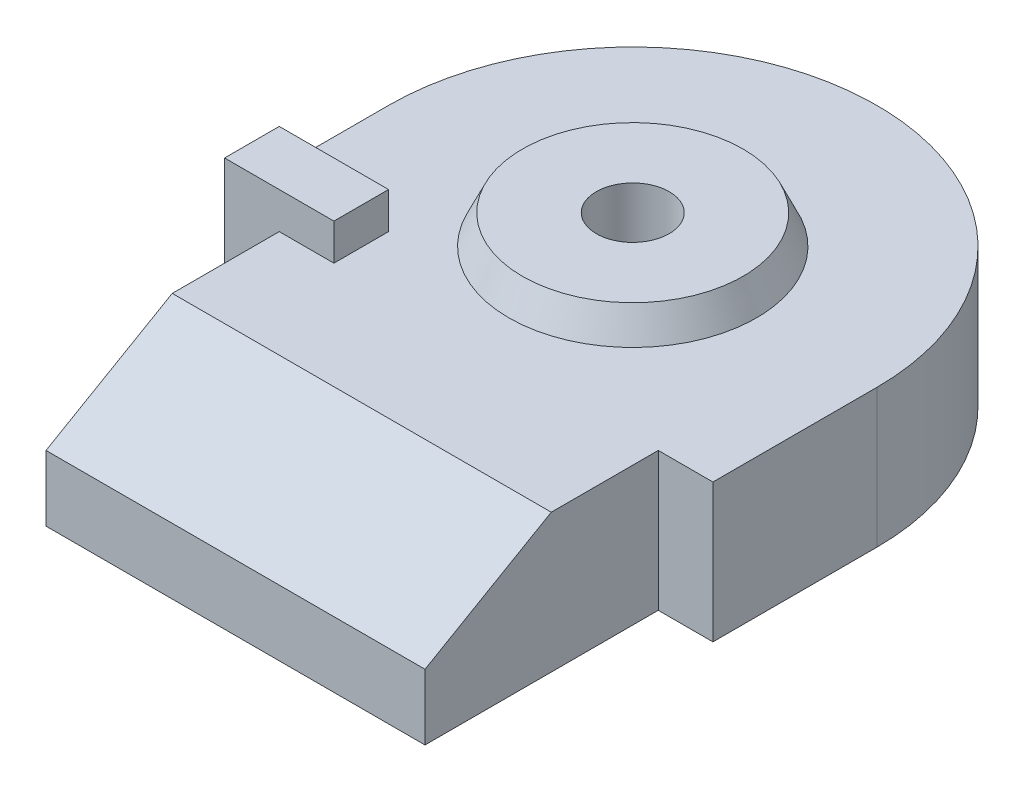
ISO-10303-21;
HEADER;
FILE_DESCRIPTION(('STEP AP214'),'2;1');
FILE_NAME('part.step','',(''),(''),'','','');
FILE_SCHEMA(('AUTOMOTIVE_DESIGN { 1 0 10303 214 1 1 1 1 }'));
ENDSEC;
DATA;
#1=APPLICATION_CONTEXT('core data for automotive mechanical design processes');
#2=APPLICATION_PROTOCOL_DEFINITION('international standard','automotive_design',2000,#1);
#3=PRODUCT_CONTEXT('',#1,'mechanical');
#4=PRODUCT('Part','Part','',(#3));
#5=PRODUCT_RELATED_PRODUCT_CATEGORY('part','',(#4));
#6=PRODUCT_DEFINITION_FORMATION('','',#4);
#7=PRODUCT_DEFINITION_CONTEXT('part definition',#1,'design');
#8=PRODUCT_DEFINITION('design','',#6,#7);
#9=PRODUCT_DEFINITION_SHAPE('','',#8);
#10=(LENGTH_UNIT() NAMED_UNIT(*) SI_UNIT(.MILLI.,.METRE.));
#11=(NAMED_UNIT(*) PLANE_ANGLE_UNIT() SI_UNIT($,.RADIAN.));
#12=(NAMED_UNIT(*) SI_UNIT($,.STERADIAN.) SOLID_ANGLE_UNIT());
#13=UNCERTAINTY_MEASURE_WITH_UNIT(LENGTH_MEASURE(1.E-05),#10,'distance_accuracy_value','');
#14=(GEOMETRIC_REPRESENTATION_CONTEXT(3) GLOBAL_UNCERTAINTY_ASSIGNED_CONTEXT((#13)) GLOBAL_UNIT_ASSIGNED_CONTEXT((#10,
#11,#12)) REPRESENTATION_CONTEXT('',''));
#15=CARTESIAN_POINT('',(0.,0.,0.));
#16=DIRECTION('',(0.,0.,1.));
#17=DIRECTION('',(1.,0.,0.));
#18=AXIS2_PLACEMENT_3D('',#15,#16,#17);
#19=CARTESIAN_POINT('',(0.,190.,0.));
#20=DIRECTION('',(0.,1.,0.));
#21=DIRECTION('',(0.,0.,1.));
#22=AXIS2_PLACEMENT_3D('',#19,#20,#21);
#23=PLANE('',#22);
#24=CARTESIAN_POINT('',(0.,190.,0.));
#25=DIRECTION('',(0.,1.,0.));
#26=DIRECTION('',(0.,0.,1.));
#27=AXIS2_PLACEMENT_3D('',#24,#25,#26);
#28=CIRCLE('',#27,170.);
#29=CARTESIAN_POINT('',(0.,190.,170.));
#30=VERTEX_POINT('',#29);
#31=EDGE_CURVE('E11',#30,#30,#28,.T.);
#32=ORIENTED_EDGE('',*,*,#31,.F.);
#33=EDGE_LOOP('',(#32));
#34=FACE_BOUND('',#33,.T.);
#35=DIRECTION('',(0.,0.,1.));
#36=VECTOR('',#35,1.);
#37=CARTESIAN_POINT('',(-260.,190.,225.));
#38=LINE('',#37,#36);
#39=CARTESIAN_POINT('',(-260.,190.,225.));
#40=VERTEX_POINT('',#39);
#41=CARTESIAN_POINT('',(-260.,190.,371.794919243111));
#42=VERTEX_POINT('',#41);
#43=EDGE_CURVE('E131',#40,#42,#38,.T.);
#44=ORIENTED_EDGE('',*,*,#43,.T.);
#45=DIRECTION('',(-1.,0.,0.));
#46=VECTOR('',#45,1.);
#47=CARTESIAN_POINT('',(1645.96073401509,190.,371.794919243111));
#48=LINE('',#47,#46);
#49=CARTESIAN_POINT('',(260.,190.,371.794919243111));
#50=VERTEX_POINT('',#49);
#51=EDGE_CURVE('E46',#50,#42,#48,.T.);
#52=ORIENTED_EDGE('',*,*,#51,.F.);
#53=DIRECTION('',(0.,0.,-1.));
#54=VECTOR('',#53,1.);
#55=CARTESIAN_POINT('',(260.,190.,225.));
#56=LINE('',#55,#54);
#57=CARTESIAN_POINT('',(260.,190.,225.));
#58=VERTEX_POINT('',#57);
#59=EDGE_CURVE('E136',#50,#58,#56,.T.);
#60=ORIENTED_EDGE('',*,*,#59,.T.);
#61=DIRECTION('',(1.,0.,0.));
#62=VECTOR('',#61,1.);
#63=CARTESIAN_POINT('',(335.,190.,225.));
#64=LINE('',#63,#62);
#65=CARTESIAN_POINT('',(335.,190.,225.));
#66=VERTEX_POINT('',#65);
#67=EDGE_CURVE('E172',#58,#66,#64,.T.);
#68=ORIENTED_EDGE('',*,*,#67,.T.);
#69=DIRECTION('',(0.,0.,-1.));
#70=VECTOR('',#69,1.);
#71=CARTESIAN_POINT('',(335.,190.,0.));
#72=LINE('',#71,#70);
#73=CARTESIAN_POINT('',(335.,190.,0.));
#74=VERTEX_POINT('',#73);
#75=EDGE_CURVE('E174',#66,#74,#72,.T.);
#76=ORIENTED_EDGE('',*,*,#75,.T.);
#77=CARTESIAN_POINT('',(0.,190.,0.));
#78=DIRECTION('',(0.,1.,0.));
#79=DIRECTION('',(0.,0.,1.));
#80=AXIS2_PLACEMENT_3D('',#77,#78,#79);
#81=CIRCLE('',#80,335.);
#82=CARTESIAN_POINT('',(-335.,190.,0.));
#83=VERTEX_POINT('',#82);
#84=EDGE_CURVE('E176',#74,#83,#81,.T.);
#85=ORIENTED_EDGE('',*,*,#84,.T.);
#86=DIRECTION('',(0.,0.,1.));
#87=VECTOR('',#86,1.);
#88=CARTESIAN_POINT('',(-335.,190.,0.));
#89=LINE('',#88,#87);
#90=CARTESIAN_POINT('',(-335.,190.,150.));
#91=VERTEX_POINT('',#90);
#92=EDGE_CURVE('E178',#83,#91,#89,.T.);
#93=ORIENTED_EDGE('',*,*,#92,.T.);
#94=DIRECTION('',(-1.,0.,0.));
#95=VECTOR('',#94,1.);
#96=CARTESIAN_POINT('',(-335.,190.,150.));
#97=LINE('',#96,#95);
#98=CARTESIAN_POINT('',(-185.,190.,150.));
#99=VERTEX_POINT('',#98);
#100=EDGE_CURVE('E153',#99,#91,#97,.T.);
#101=ORIENTED_EDGE('',*,*,#100,.F.);
#102=DIRECTION('',(0.,0.,-1.));
#103=VECTOR('',#102,1.);
#104=CARTESIAN_POINT('',(-185.,190.,225.));
#105=LINE('',#104,#103);
#106=CARTESIAN_POINT('',(-185.,190.,225.));
#107=VERTEX_POINT('',#106);
#108=EDGE_CURVE('E158',#107,#99,#105,.T.);
#109=ORIENTED_EDGE('',*,*,#108,.F.);
#110=DIRECTION('',(1.,0.,0.));
#111=VECTOR('',#110,1.);
#112=CARTESIAN_POINT('',(-335.,190.,225.));
#113=LINE('',#112,#111);
#114=EDGE_CURVE('E141',#40,#107,#113,.T.);
#115=ORIENTED_EDGE('',*,*,#114,.F.);
#116=EDGE_LOOP('',(#44,#52,#60,#68,#76,#85,#93,#101,#109,#115));
#117=FACE_BOUND('',#116,.T.);
#118=ADVANCED_FACE('F31',(#34,#117),#23,.T.);
#119=CARTESIAN_POINT('',(260.,190.,225.));
#120=DIRECTION('',(-1.,0.,0.));
#121=DIRECTION('',(0.,0.,1.));
#122=AXIS2_PLACEMENT_3D('',#119,#120,#121);
#123=PLANE('',#122);
#124=DIRECTION('',(0.,0.499999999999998,-0.86602540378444));
#125=VECTOR('',#124,1.);
#126=CARTESIAN_POINT('',(260.,253.56406460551,261.698729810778));
#127=LINE('',#126,#125);
#128=CARTESIAN_POINT('',(260.,90.,545.));
#129=VERTEX_POINT('',#128);
#130=EDGE_CURVE('E134',#129,#50,#127,.T.);
#131=ORIENTED_EDGE('',*,*,#130,.F.);
#132=DIRECTION('',(0.,-1.,0.));
#133=VECTOR('',#132,1.);
#134=CARTESIAN_POINT('',(260.,190.,545.));
#135=LINE('',#134,#133);
#136=CARTESIAN_POINT('',(260.,0.,545.));
#137=VERTEX_POINT('',#136);
#138=EDGE_CURVE('E121',#129,#137,#135,.T.);
#139=ORIENTED_EDGE('',*,*,#138,.T.);
#140=DIRECTION('',(0.,0.,-1.));
#141=VECTOR('',#140,1.);
#142=CARTESIAN_POINT('',(260.,0.,225.));
#143=LINE('',#142,#141);
#144=CARTESIAN_POINT('',(260.,0.,225.));
#145=VERTEX_POINT('',#144);
#146=EDGE_CURVE('E170',#137,#145,#143,.T.);
#147=ORIENTED_EDGE('',*,*,#146,.T.);
#148=DIRECTION('',(0.,-1.,0.));
#149=VECTOR('',#148,1.);
#150=CARTESIAN_POINT('',(260.,190.,225.));
#151=LINE('',#150,#149);
#152=EDGE_CURVE('E143',#58,#145,#151,.T.);
#153=ORIENTED_EDGE('',*,*,#152,.F.);
#154=ORIENTED_EDGE('',*,*,#59,.F.);
#155=EDGE_LOOP('',(#131,#139,#147,#153,#154));
#156=FACE_BOUND('',#155,.T.);
#157=ADVANCED_FACE('F33',(#156),#123,.F.);
#158=CARTESIAN_POINT('',(-260.,190.,225.));
#159=DIRECTION('',(1.,0.,0.));
#160=DIRECTION('',(0.,0.,-1.));
#161=AXIS2_PLACEMENT_3D('',#158,#159,#160);
#162=PLANE('',#161);
#163=DIRECTION('',(0.,-0.499999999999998,0.86602540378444));
#164=VECTOR('',#163,1.);
#165=CARTESIAN_POINT('',(-260.,253.56406460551,261.698729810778));
#166=LINE('',#165,#164);
#167=CARTESIAN_POINT('',(-260.,90.,545.));
#168=VERTEX_POINT('',#167);
#169=EDGE_CURVE('E54',#42,#168,#166,.T.);
#170=ORIENTED_EDGE('',*,*,#169,.F.);
#171=ORIENTED_EDGE('',*,*,#43,.F.);
#172=DIRECTION('',(0.,-1.,0.));
#173=VECTOR('',#172,1.);
#174=CARTESIAN_POINT('',(-260.,190.,225.));
#175=LINE('',#174,#173);
#176=CARTESIAN_POINT('',(-260.,0.,225.));
#177=VERTEX_POINT('',#176);
#178=EDGE_CURVE('E188',#40,#177,#175,.T.);
#179=ORIENTED_EDGE('',*,*,#178,.T.);
#180=DIRECTION('',(0.,0.,1.));
#181=VECTOR('',#180,1.);
#182=CARTESIAN_POINT('',(-260.,0.,225.));
#183=LINE('',#182,#181);
#184=CARTESIAN_POINT('',(-260.,0.,545.));
#185=VERTEX_POINT('',#184);
#186=EDGE_CURVE('E249',#177,#185,#183,.T.);
#187=ORIENTED_EDGE('',*,*,#186,.T.);
#188=DIRECTION('',(0.,-1.,0.));
#189=VECTOR('',#188,1.);
#190=CARTESIAN_POINT('',(-260.,190.,545.));
#191=LINE('',#190,#189);
#192=EDGE_CURVE('E130',#168,#185,#191,.T.);
#193=ORIENTED_EDGE('',*,*,#192,.F.);
#194=EDGE_LOOP('',(#170,#171,#179,#187,#193));
#195=FACE_BOUND('',#194,.T.);
#196=ADVANCED_FACE('F287',(#195),#162,.F.);
#197=CARTESIAN_POINT('',(-260.,190.,545.));
#198=DIRECTION('',(0.,0.,-1.));
#199=DIRECTION('',(-1.,0.,0.));
#200=AXIS2_PLACEMENT_3D('',#197,#198,#199);
#201=PLANE('',#200);
#202=DIRECTION('',(1.,0.,0.));
#203=VECTOR('',#202,1.);
#204=CARTESIAN_POINT('',(-260.,90.,545.));
#205=LINE('',#204,#203);
#206=EDGE_CURVE('E39',#168,#129,#205,.T.);
#207=ORIENTED_EDGE('',*,*,#206,.F.);
#208=ORIENTED_EDGE('',*,*,#192,.T.);
#209=DIRECTION('',(1.,0.,0.));
#210=VECTOR('',#209,1.);
#211=CARTESIAN_POINT('',(-260.,0.,545.));
#212=LINE('',#211,#210);
#213=EDGE_CURVE('E126',#185,#137,#212,.T.);
#214=ORIENTED_EDGE('',*,*,#213,.T.);
#215=ORIENTED_EDGE('',*,*,#138,.F.);
#216=EDGE_LOOP('',(#207,#208,#214,#215));
#217=FACE_BOUND('',#216,.T.);
#218=ADVANCED_FACE('F123',(#217),#201,.F.);
#219=CARTESIAN_POINT('',(0.,0.,0.));
#220=DIRECTION('',(0.,1.,0.));
#221=DIRECTION('',(0.,0.,1.));
#222=AXIS2_PLACEMENT_3D('',#219,#220,#221);
#223=PLANE('',#222);
#224=ORIENTED_EDGE('',*,*,#146,.F.);
#225=ORIENTED_EDGE('',*,*,#213,.F.);
#226=ORIENTED_EDGE('',*,*,#186,.F.);
#227=DIRECTION('',(1.,0.,0.));
#228=VECTOR('',#227,1.);
#229=CARTESIAN_POINT('',(-335.,0.,225.));
#230=LINE('',#229,#228);
#231=CARTESIAN_POINT('',(-335.,0.,225.));
#232=VERTEX_POINT('',#231);
#233=EDGE_CURVE('E247',#232,#177,#230,.T.);
#234=ORIENTED_EDGE('',*,*,#233,.F.);
#235=DIRECTION('',(0.,0.,1.));
#236=VECTOR('',#235,1.);
#237=CARTESIAN_POINT('',(-335.,0.,0.));
#238=LINE('',#237,#236);
#239=CARTESIAN_POINT('',(-335.,0.,0.));
#240=VERTEX_POINT('',#239);
#241=EDGE_CURVE('E225',#240,#232,#238,.T.);
#242=ORIENTED_EDGE('',*,*,#241,.F.);
#243=CARTESIAN_POINT('',(0.,0.,0.));
#244=DIRECTION('',(0.,1.,0.));
#245=DIRECTION('',(0.,0.,1.));
#246=AXIS2_PLACEMENT_3D('',#243,#244,#245);
#247=CIRCLE('',#246,335.);
#248=CARTESIAN_POINT('',(335.,0.,0.));
#249=VERTEX_POINT('',#248);
#250=EDGE_CURVE('E245',#249,#240,#247,.T.);
#251=ORIENTED_EDGE('',*,*,#250,.F.);
#252=DIRECTION('',(0.,0.,-1.));
#253=VECTOR('',#252,1.);
#254=CARTESIAN_POINT('',(335.,0.,0.));
#255=LINE('',#254,#253);
#256=CARTESIAN_POINT('',(335.,0.,225.));
#257=VERTEX_POINT('',#256);
#258=EDGE_CURVE('E251',#257,#249,#255,.T.);
#259=ORIENTED_EDGE('',*,*,#258,.F.);
#260=DIRECTION('',(1.,0.,0.));
#261=VECTOR('',#260,1.);
#262=CARTESIAN_POINT('',(335.,0.,225.));
#263=LINE('',#262,#261);
#264=EDGE_CURVE('E269',#145,#257,#263,.T.);
#265=ORIENTED_EDGE('',*,*,#264,.F.);
#266=EDGE_LOOP('',(#224,#225,#226,#234,#242,#251,#259,#265));
#267=FACE_BOUND('',#266,.T.);
#268=CARTESIAN_POINT('',(0.,0.,0.));
#269=DIRECTION('',(0.,1.,0.));
#270=DIRECTION('',(0.,0.,1.));
#271=AXIS2_PLACEMENT_3D('',#268,#269,#270);
#272=CIRCLE('',#271,50.);
#273=CARTESIAN_POINT('',(0.,0.,-50.));
#274=VERTEX_POINT('',#273);
#275=EDGE_CURVE('E138',#274,#274,#272,.T.);
#276=ORIENTED_EDGE('',*,*,#275,.T.);
#277=EDGE_LOOP('',(#276));
#278=FACE_BOUND('',#277,.T.);
#279=ADVANCED_FACE('F242',(#267,#278),#223,.F.);
#280=CARTESIAN_POINT('',(335.,190.,225.));
#281=DIRECTION('',(0.,0.,-1.));
#282=DIRECTION('',(-1.,0.,0.));
#283=AXIS2_PLACEMENT_3D('',#280,#281,#282);
#284=PLANE('',#283);
#285=ORIENTED_EDGE('',*,*,#264,.T.);
#286=DIRECTION('',(0.,-1.,0.));
#287=VECTOR('',#286,1.);
#288=CARTESIAN_POINT('',(335.,190.,225.));
#289=LINE('',#288,#287);
#290=EDGE_CURVE('E260',#66,#257,#289,.T.);
#291=ORIENTED_EDGE('',*,*,#290,.F.);
#292=ORIENTED_EDGE('',*,*,#67,.F.);
#293=ORIENTED_EDGE('',*,*,#152,.T.);
#294=EDGE_LOOP('',(#285,#291,#292,#293));
#295=FACE_BOUND('',#294,.T.);
#296=ADVANCED_FACE('F268',(#295),#284,.F.);
#297=CARTESIAN_POINT('',(335.,190.,0.));
#298=DIRECTION('',(-1.,0.,0.));
#299=DIRECTION('',(0.,0.,1.));
#300=AXIS2_PLACEMENT_3D('',#297,#298,#299);
#301=PLANE('',#300);
#302=ORIENTED_EDGE('',*,*,#258,.T.);
#303=DIRECTION('',(0.,-1.,0.));
#304=VECTOR('',#303,1.);
#305=CARTESIAN_POINT('',(335.,190.,0.));
#306=LINE('',#305,#304);
#307=EDGE_CURVE('E238',#74,#249,#306,.T.);
#308=ORIENTED_EDGE('',*,*,#307,.F.);
#309=ORIENTED_EDGE('',*,*,#75,.F.);
#310=ORIENTED_EDGE('',*,*,#290,.T.);
#311=EDGE_LOOP('',(#302,#308,#309,#310));
#312=FACE_BOUND('',#311,.T.);
#313=ADVANCED_FACE('F271',(#312),#301,.F.);
#314=CARTESIAN_POINT('',(0.,190.,0.));
#315=DIRECTION('',(0.,-1.,0.));
#316=DIRECTION('',(0.,0.,-1.));
#317=AXIS2_PLACEMENT_3D('',#314,#315,#316);
#318=CYLINDRICAL_SURFACE('',#317,335.);
#319=ORIENTED_EDGE('',*,*,#250,.T.);
#320=DIRECTION('',(0.,-1.,0.));
#321=VECTOR('',#320,1.);
#322=CARTESIAN_POINT('',(-335.,190.,0.));
#323=LINE('',#322,#321);
#324=EDGE_CURVE('E228',#83,#240,#323,.T.);
#325=ORIENTED_EDGE('',*,*,#324,.F.);
#326=ORIENTED_EDGE('',*,*,#84,.F.);
#327=ORIENTED_EDGE('',*,*,#307,.T.);
#328=EDGE_LOOP('',(#319,#325,#326,#327));
#329=FACE_BOUND('',#328,.T.);
#330=ADVANCED_FACE('F272',(#329),#318,.T.);
#331=CARTESIAN_POINT('',(-335.,190.,0.));
#332=DIRECTION('',(1.,0.,0.));
#333=DIRECTION('',(0.,0.,-1.));
#334=AXIS2_PLACEMENT_3D('',#331,#332,#333);
#335=PLANE('',#334);
#336=ORIENTED_EDGE('',*,*,#241,.T.);
#337=DIRECTION('',(0.,-1.,0.));
#338=VECTOR('',#337,1.);
#339=CARTESIAN_POINT('',(-335.,190.,225.));
#340=LINE('',#339,#338);
#341=CARTESIAN_POINT('',(-335.,240.,225.));
#342=VERTEX_POINT('',#341);
#343=EDGE_CURVE('E191',#342,#232,#340,.T.);
#344=ORIENTED_EDGE('',*,*,#343,.F.);
#345=DIRECTION('',(0.,0.,1.));
#346=VECTOR('',#345,1.);
#347=CARTESIAN_POINT('',(-335.,240.,225.));
#348=LINE('',#347,#346);
#349=CARTESIAN_POINT('',(-335.,240.,150.));
#350=VERTEX_POINT('',#349);
#351=EDGE_CURVE('E157',#350,#342,#348,.T.);
#352=ORIENTED_EDGE('',*,*,#351,.F.);
#353=DIRECTION('',(0.,-1.,0.));
#354=VECTOR('',#353,1.);
#355=CARTESIAN_POINT('',(-335.,240.,150.));
#356=LINE('',#355,#354);
#357=EDGE_CURVE('E148',#350,#91,#356,.T.);
#358=ORIENTED_EDGE('',*,*,#357,.T.);
#359=ORIENTED_EDGE('',*,*,#92,.F.);
#360=ORIENTED_EDGE('',*,*,#324,.T.);
#361=EDGE_LOOP('',(#336,#344,#352,#358,#359,#360));
#362=FACE_BOUND('',#361,.T.);
#363=ADVANCED_FACE('F220',(#362),#335,.F.);
#364=CARTESIAN_POINT('',(-335.,190.,225.));
#365=DIRECTION('',(0.,0.,-1.));
#366=DIRECTION('',(-1.,0.,0.));
#367=AXIS2_PLACEMENT_3D('',#364,#365,#366);
#368=PLANE('',#367);
#369=ORIENTED_EDGE('',*,*,#233,.T.);
#370=ORIENTED_EDGE('',*,*,#178,.F.);
#371=ORIENTED_EDGE('',*,*,#114,.T.);
#372=DIRECTION('',(0.,-1.,0.));
#373=VECTOR('',#372,1.);
#374=CARTESIAN_POINT('',(-185.,240.,225.));
#375=LINE('',#374,#373);
#376=CARTESIAN_POINT('',(-185.,240.,225.));
#377=VERTEX_POINT('',#376);
#378=EDGE_CURVE('E167',#377,#107,#375,.T.);
#379=ORIENTED_EDGE('',*,*,#378,.F.);
#380=DIRECTION('',(1.,0.,0.));
#381=VECTOR('',#380,1.);
#382=CARTESIAN_POINT('',(-335.,240.,225.));
#383=LINE('',#382,#381);
#384=EDGE_CURVE('E206',#342,#377,#383,.T.);
#385=ORIENTED_EDGE('',*,*,#384,.F.);
#386=ORIENTED_EDGE('',*,*,#343,.T.);
#387=EDGE_LOOP('',(#369,#370,#371,#379,#385,#386));
#388=FACE_BOUND('',#387,.T.);
#389=ADVANCED_FACE('F231',(#388),#368,.F.);
#390=CARTESIAN_POINT('',(-185.,240.,225.));
#391=DIRECTION('',(-1.,0.,0.));
#392=DIRECTION('',(0.,0.,1.));
#393=AXIS2_PLACEMENT_3D('',#390,#391,#392);
#394=PLANE('',#393);
#395=ORIENTED_EDGE('',*,*,#108,.T.);
#396=DIRECTION('',(0.,-1.,0.));
#397=VECTOR('',#396,1.);
#398=CARTESIAN_POINT('',(-185.,240.,150.));
#399=LINE('',#398,#397);
#400=CARTESIAN_POINT('',(-185.,240.,150.));
#401=VERTEX_POINT('',#400);
#402=EDGE_CURVE('E151',#401,#99,#399,.T.);
#403=ORIENTED_EDGE('',*,*,#402,.F.);
#404=DIRECTION('',(0.,0.,-1.));
#405=VECTOR('',#404,1.);
#406=CARTESIAN_POINT('',(-185.,240.,225.));
#407=LINE('',#406,#405);
#408=EDGE_CURVE('E208',#377,#401,#407,.T.);
#409=ORIENTED_EDGE('',*,*,#408,.F.);
#410=ORIENTED_EDGE('',*,*,#378,.T.);
#411=EDGE_LOOP('',(#395,#403,#409,#410));
#412=FACE_BOUND('',#411,.T.);
#413=ADVANCED_FACE('F234',(#412),#394,.F.);
#414=CARTESIAN_POINT('',(-335.,240.,150.));
#415=DIRECTION('',(0.,0.,1.));
#416=DIRECTION('',(1.,0.,0.));
#417=AXIS2_PLACEMENT_3D('',#414,#415,#416);
#418=PLANE('',#417);
#419=ORIENTED_EDGE('',*,*,#100,.T.);
#420=ORIENTED_EDGE('',*,*,#357,.F.);
#421=DIRECTION('',(-1.,0.,0.));
#422=VECTOR('',#421,1.);
#423=CARTESIAN_POINT('',(-335.,240.,150.));
#424=LINE('',#423,#422);
#425=EDGE_CURVE('E152',#401,#350,#424,.T.);
#426=ORIENTED_EDGE('',*,*,#425,.F.);
#427=ORIENTED_EDGE('',*,*,#402,.T.);
#428=EDGE_LOOP('',(#419,#420,#426,#427));
#429=FACE_BOUND('',#428,.T.);
#430=ADVANCED_FACE('F217',(#429),#418,.F.);
#431=CARTESIAN_POINT('',(-335.,240.,150.));
#432=DIRECTION('',(0.,-1.,0.));
#433=DIRECTION('',(0.,0.,-1.));
#434=AXIS2_PLACEMENT_3D('',#431,#432,#433);
#435=PLANE('',#434);
#436=ORIENTED_EDGE('',*,*,#351,.T.);
#437=ORIENTED_EDGE('',*,*,#384,.T.);
#438=ORIENTED_EDGE('',*,*,#408,.T.);
#439=ORIENTED_EDGE('',*,*,#425,.T.);
#440=EDGE_LOOP('',(#436,#437,#438,#439));
#441=FACE_BOUND('',#440,.T.);
#442=ADVANCED_FACE('F212',(#441),#435,.F.);
#443=CARTESIAN_POINT('',(0.,240.000025,0.));
#444=DIRECTION('',(0.,-1.,0.));
#445=DIRECTION('',(0.,0.,-1.));
#446=AXIS2_PLACEMENT_3D('',#443,#444,#445);
#447=CYLINDRICAL_SURFACE('',#446,50.);
#448=CARTESIAN_POINT('',(0.,230.,0.));
#449=DIRECTION('',(0.,-1.,0.));
#450=DIRECTION('',(0.,0.,-1.));
#451=AXIS2_PLACEMENT_3D('',#448,#449,#450);
#452=CIRCLE('',#451,50.);
#453=CARTESIAN_POINT('',(0.,230.,-50.));
#454=VERTEX_POINT('',#453);
#455=EDGE_CURVE('E194',#454,#454,#452,.T.);
#456=CARTESIAN_POINT('',(0.,0.,-50.));
#457=CARTESIAN_POINT('',(0.,2.39583333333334,-50.));
#458=CARTESIAN_POINT('',(0.,4.79166666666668,-50.));
#459=CARTESIAN_POINT('',(0.,9.58333333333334,-50.));
#460=CARTESIAN_POINT('',(0.,11.9791666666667,-50.));
#461=CARTESIAN_POINT('',(0.,16.7708333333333,-50.));
#462=CARTESIAN_POINT('',(0.,19.1666666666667,-50.));
#463=CARTESIAN_POINT('',(0.,23.9583333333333,-50.));
#464=CARTESIAN_POINT('',(0.,26.3541666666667,-50.));
#465=CARTESIAN_POINT('',(0.,31.1458333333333,-50.));
#466=CARTESIAN_POINT('',(0.,33.5416666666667,-50.));
#467=CARTESIAN_POINT('',(0.,38.3333333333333,-50.));
#468=CARTESIAN_POINT('',(0.,40.7291666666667,-50.));
#469=CARTESIAN_POINT('',(0.,45.5208333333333,-50.));
#470=CARTESIAN_POINT('',(0.,47.9166666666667,-50.));
#471=CARTESIAN_POINT('',(0.,52.7083333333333,-50.));
#472=CARTESIAN_POINT('',(0.,55.1041666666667,-50.));
#473=CARTESIAN_POINT('',(0.,59.8958333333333,-50.));
#474=CARTESIAN_POINT('',(0.,62.2916666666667,-50.));
#475=CARTESIAN_POINT('',(0.,67.0833333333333,-50.));
#476=CARTESIAN_POINT('',(0.,69.4791666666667,-50.));
#477=CARTESIAN_POINT('',(0.,74.2708333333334,-50.));
#478=CARTESIAN_POINT('',(0.,76.6666666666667,-50.));
#479=CARTESIAN_POINT('',(0.,81.4583333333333,-50.));
#480=CARTESIAN_POINT('',(0.,83.8541666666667,-50.));
#481=CARTESIAN_POINT('',(0.,88.6458333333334,-50.));
#482=CARTESIAN_POINT('',(0.,91.0416666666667,-50.));
#483=CARTESIAN_POINT('',(0.,95.8333333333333,-50.));
#484=CARTESIAN_POINT('',(0.,98.2291666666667,-50.));
#485=CARTESIAN_POINT('',(0.,103.020833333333,-50.));
#486=CARTESIAN_POINT('',(0.,105.416666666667,-50.));
#487=CARTESIAN_POINT('',(0.,110.208333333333,-50.));
#488=CARTESIAN_POINT('',(0.,112.604166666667,-50.));
#489=CARTESIAN_POINT('',(0.,117.395833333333,-50.));
#490=CARTESIAN_POINT('',(0.,119.791666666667,-50.));
#491=CARTESIAN_POINT('',(0.,124.583333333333,-50.));
#492=CARTESIAN_POINT('',(0.,126.979166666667,-50.));
#493=CARTESIAN_POINT('',(0.,131.770833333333,-50.));
#494=CARTESIAN_POINT('',(0.,134.166666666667,-50.));
#495=CARTESIAN_POINT('',(0.,138.958333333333,-50.));
#496=CARTESIAN_POINT('',(0.,141.354166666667,-50.));
#497=CARTESIAN_POINT('',(0.,146.145833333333,-50.));
#498=CARTESIAN_POINT('',(0.,148.541666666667,-50.));
#499=CARTESIAN_POINT('',(0.,153.333333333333,-50.));
#500=CARTESIAN_POINT('',(0.,155.729166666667,-50.));
#501=CARTESIAN_POINT('',(0.,160.520833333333,-50.));
#502=CARTESIAN_POINT('',(0.,162.916666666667,-50.));
#503=CARTESIAN_POINT('',(0.,167.708333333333,-50.));
#504=CARTESIAN_POINT('',(0.,170.104166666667,-50.));
#505=CARTESIAN_POINT('',(0.,174.895833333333,-50.));
#506=CARTESIAN_POINT('',(0.,177.291666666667,-50.));
#507=CARTESIAN_POINT('',(0.,182.083333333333,-50.));
#508=CARTESIAN_POINT('',(0.,184.479166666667,-50.));
#509=CARTESIAN_POINT('',(0.,189.270833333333,-50.));
#510=CARTESIAN_POINT('',(0.,191.666666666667,-50.));
#511=CARTESIAN_POINT('',(0.,196.458333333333,-50.));
#512=CARTESIAN_POINT('',(0.,198.854166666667,-50.));
#513=CARTESIAN_POINT('',(0.,203.645833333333,-50.));
#514=CARTESIAN_POINT('',(0.,206.041666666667,-50.));
#515=CARTESIAN_POINT('',(0.,210.833333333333,-50.));
#516=CARTESIAN_POINT('',(0.,213.229166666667,-50.));
#517=CARTESIAN_POINT('',(0.,218.020833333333,-50.));
#518=CARTESIAN_POINT('',(0.,220.416666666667,-50.));
#519=CARTESIAN_POINT('',(0.,225.208333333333,-50.));
#520=CARTESIAN_POINT('',(0.,227.604166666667,-50.));
#521=CARTESIAN_POINT('',(0.,230.,-50.));
#522=B_SPLINE_CURVE_WITH_KNOTS('',3,(#456,#457,#458,#459,#460,#461,#462,#463,#464,#465,#466,
#467,#468,#469,#470,#471,#472,#473,#474,#475,#476,#477,#478,#479,#480,#481,#482,#483,#484,#485,
#486,#487,#488,#489,#490,#491,#492,#493,#494,#495,#496,#497,#498,#499,#500,#501,#502,#503,#504,
#505,#506,#507,#508,#509,#510,#511,#512,#513,#514,#515,#516,#517,#518,#519,#520,#521),
.UNSPECIFIED.,.F.,.F.,(4,2,2,2,2,2,2,2,2,2,2,2,2,2,2,2,2,2,2,2,2,2,2,2,2,2,2,2,2,2,2,2,4),(0.,
7.18750000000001,14.375,21.5625,28.75,35.9375,43.125,50.3125,57.5,64.6875,71.875,79.0625,86.25,
93.4375,100.625,107.8125,115.,122.1875,129.375,136.5625,143.75,150.9375,158.125,165.3125,172.5,
179.6875,186.875,194.0625,201.25,208.4375,215.625,222.8125,230.),.UNSPECIFIED.);
#523=EDGE_CURVE('BSEAM308',#274,#454,#522,.T.);
#524=ORIENTED_EDGE('',*,*,#275,.F.);
#525=ORIENTED_EDGE('',*,*,#455,.F.);
#526=ORIENTED_EDGE('',*,*,#523,.T.);
#527=ORIENTED_EDGE('',*,*,#523,.F.);
#528=EDGE_LOOP('',(#524,#526,#525,#527));
#529=FACE_BOUND('',#528,.T.);
#530=ADVANCED_FACE('F308',(#529),#447,.F.);
#531=CARTESIAN_POINT('',(1645.96073401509,90.,545.));
#532=DIRECTION('',(0.,0.86602540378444,0.499999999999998));
#533=DIRECTION('',(0.,-0.499999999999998,0.86602540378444));
#534=AXIS2_PLACEMENT_3D('',#531,#532,#533);
#535=PLANE('',#534);
#536=ORIENTED_EDGE('',*,*,#206,.T.);
#537=ORIENTED_EDGE('',*,*,#130,.T.);
#538=ORIENTED_EDGE('',*,*,#51,.T.);
#539=ORIENTED_EDGE('',*,*,#169,.T.);
#540=EDGE_LOOP('',(#536,#537,#538,#539));
#541=FACE_BOUND('',#540,.T.);
#542=ADVANCED_FACE('F140',(#541),#535,.T.);
#543=CARTESIAN_POINT('',(0.,230.,-50.));
#544=DIRECTION('',(0.,1.,0.));
#545=DIRECTION('',(0.,0.,1.));
#546=AXIS2_PLACEMENT_3D('',#543,#544,#545);
#547=PLANE('',#546);
#548=ORIENTED_EDGE('',*,*,#455,.T.);
#549=EDGE_LOOP('',(#548));
#550=FACE_BOUND('',#549,.T.);
#551=CARTESIAN_POINT('',(0.,230.,0.));
#552=DIRECTION('',(0.,-1.,0.));
#553=DIRECTION('',(0.,0.,-1.));
#554=AXIS2_PLACEMENT_3D('',#551,#552,#553);
#555=CIRCLE('',#554,151.3476936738);
#556=CARTESIAN_POINT('',(0.,230.,-151.3476936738));
#557=VERTEX_POINT('',#556);
#558=EDGE_CURVE('E198',#557,#557,#555,.T.);
#559=ORIENTED_EDGE('',*,*,#558,.F.);
#560=EDGE_LOOP('',(#559));
#561=FACE_BOUND('',#560,.T.);
#562=ADVANCED_FACE('F316',(#550,#561),#547,.T.);
#563=CARTESIAN_POINT('',(0.,190.,0.));
#564=DIRECTION('',(0.,-1.,0.));
#565=DIRECTION('',(0.,0.,-1.));
#566=AXIS2_PLACEMENT_3D('',#563,#564,#565);
#567=CONICAL_SURFACE('',#566,170.,0.43633231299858);
#568=ORIENTED_EDGE('',*,*,#558,.T.);
#569=EDGE_LOOP('',(#568));
#570=FACE_BOUND('',#569,.T.);
#571=ORIENTED_EDGE('',*,*,#31,.T.);
#572=EDGE_LOOP('',(#571));
#573=FACE_BOUND('',#572,.T.);
#574=ADVANCED_FACE('F319',(#570,#573),#567,.T.);
#575=CLOSED_SHELL('',(#118,#157,#196,#218,#279,#296,#313,#330,#363,#389,#413,#430,#442,#530,
#542,#562,#574));
#576=MANIFOLD_SOLID_BREP('B2',#575);
#577=ADVANCED_BREP_SHAPE_REPRESENTATION('',(#18,#576),#14);
#578=SHAPE_DEFINITION_REPRESENTATION(#9,#577);
ENDSEC;
END-ISO-10303-21;
